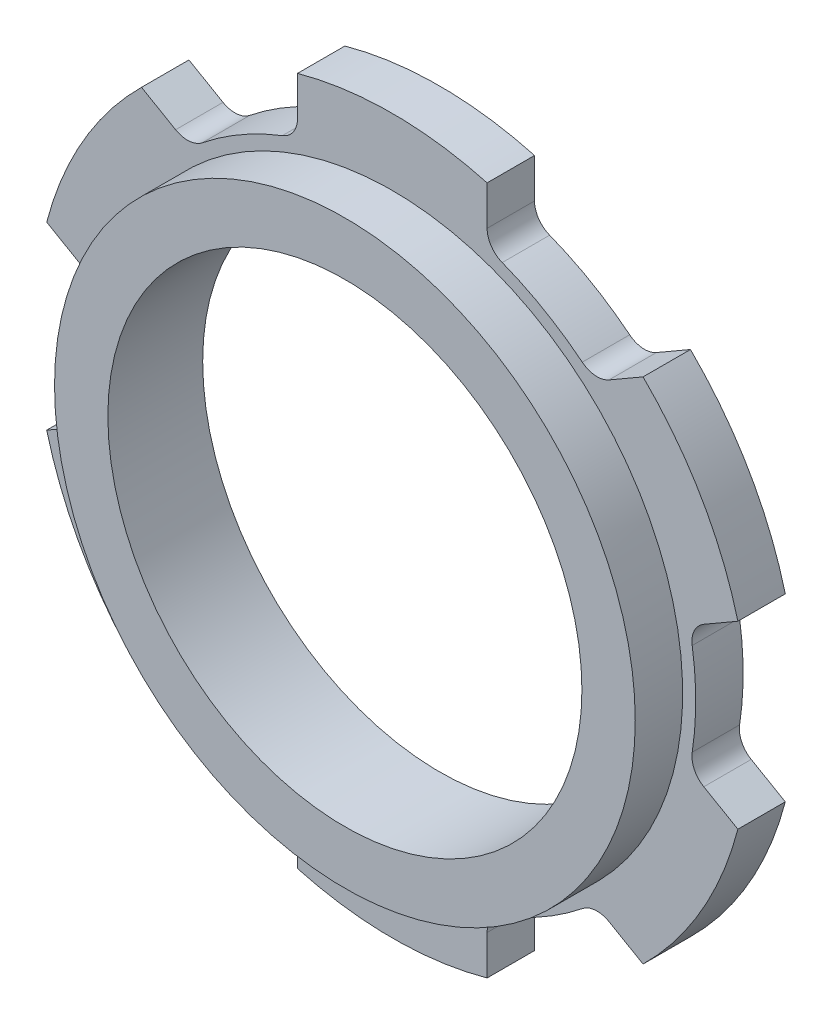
from build123d import *
from build123d.topology import SkipClean

# Parameters (mm, degrees)
ESQUISSE1_R      = 12.25
ESQUISSE1_R_2    = 10
EXTRUSION1_DEPTH = 2
EXTRUSION2_START = 2
ESQUISSE2_R      = 10
EXTRUSION2_DEPTH = 2
CONG_1_R         = 1


with BuildPart() as part:
    # Esquisse1 → Extrusion1 (new body)
    with BuildSketch(Plane.XY):
        Circle(ESQUISSE1_R)
        Circle(ESQUISSE1_R_2, mode=Mode.SUBTRACT)
    extrude(amount=EXTRUSION1_DEPTH)

    # Esquisse2 → Extrusion2 (add)
    with SkipClean():  # the faces are left unmerged after this step: merging them gives an invalid solid
        with BuildSketch(Plane(origin=(0, 0, 0), x_dir=(-1, 0, 0), z_dir=(0, 0, -1)).offset(EXTRUSION2_START)):
            with BuildLine():
                Line((4, 14.525914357), (4, 12.16144009))
                ThreePointArc((4, 12.16144009), (6.401183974, 11.087175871), (8.532116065, 9.54482166))
                Line((8.532116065, 9.54482166), (10.579810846, 10.727058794))
                ThreePointArc((10.579810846, 10.727058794), (13.048051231, 7.533295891), (14.579810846, 3.798855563))
                Line((14.579810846, 3.798855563), (12.532116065, 2.61661843))
                ThreePointArc((12.532116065, 2.61661843), (12.802367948, 0), (12.532116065, -2.61661843))
                Line((12.532116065, -2.61661843), (14.579810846, -3.798855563))
                ThreePointArc((14.579810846, -3.798855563), (13.048051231, -7.533295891), (10.579810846, -10.727058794))
                Line((10.579810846, -10.727058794), (8.532116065, -9.54482166))
                ThreePointArc((8.532116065, -9.54482166), (6.401183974, -11.087175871), (4, -12.16144009))
                Line((4, -12.16144009), (4, -14.525914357))
                ThreePointArc((4, -14.525914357), (0, -15.066591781), (-4, -14.525914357))
                Line((-4, -14.525914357), (-4, -12.16144009))
                ThreePointArc((-4, -12.16144009), (-6.401183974, -11.087175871), (-8.532116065, -9.54482166))
                Line((-8.532116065, -9.54482166), (-10.579810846, -10.727058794))
                ThreePointArc((-10.579810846, -10.727058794), (-13.048051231, -7.533295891), (-14.579810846, -3.798855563))
                Line((-14.579810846, -3.798855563), (-12.532116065, -2.61661843))
                ThreePointArc((-12.532116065, -2.61661843), (-12.802367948, 0), (-12.532116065, 2.61661843))
                Line((-12.532116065, 2.61661843), (-14.579810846, 3.798855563))
                ThreePointArc((-14.579810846, 3.798855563), (-13.048051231, 7.533295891), (-10.579810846, 10.727058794))
                Line((-10.579810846, 10.727058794), (-8.532116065, 9.54482166))
                ThreePointArc((-8.532116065, 9.54482166), (-6.401183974, 11.087175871), (-4, 12.16144009))
                Line((-4, 12.16144009), (-4, 14.525914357))
                ThreePointArc((-4, 14.525914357), (0, 15.066591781), (4, 14.525914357))
            make_face()
            Circle(ESQUISSE2_R, mode=Mode.SUBTRACT)
        extrude(amount=-EXTRUSION2_DEPTH)

    # Cong_1
    cong_1_edges = [part.edges().sort_by_distance(p)[0] for p in [
        (-8.532116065, 9.54482166, -1),
        (-4, 12.16144009, -1),
        (4, 12.16144009, -1),
        (8.532116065, 9.54482166, -1),
        (12.532116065, 2.61661843, -1),
        (12.532116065, -2.61661843, -1),
        (8.532116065, -9.54482166, -1),
        (4, -12.16144009, -1),
        (-4, -12.16144009, -1),
        (-8.532116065, -9.54482166, -1),
        (-12.532116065, -2.61661843, -1),
        (-12.532116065, 2.61661843, -1),
    ]]
    fillet(cong_1_edges, radius=CONG_1_R)


solid = part.part
